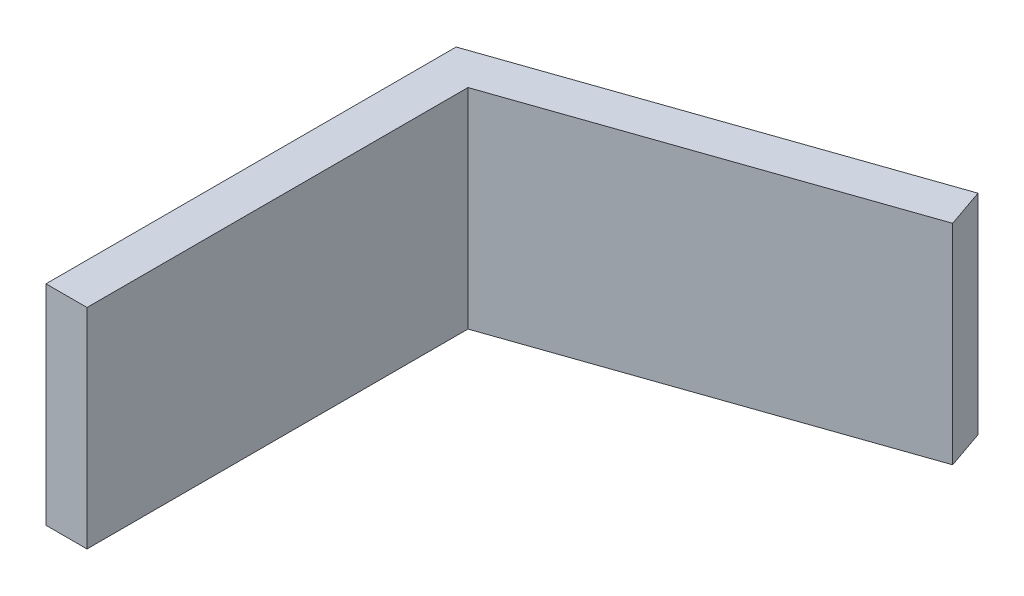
from build123d import *

# Parameters (mm, degrees)
SALIENTE_EXTRUIR1_DEPTH = 25.5


with BuildPart() as part:
    # Croquis1 → Saliente-Extruir1 (new, symmetric)
    with BuildSketch(Plane(origin=(0, 0, 0), x_dir=(1, 0, 0), z_dir=(0, 1, 0))):
        Polygon((-5, 91.117591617), (-5, -8.882408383), (5, -8.882408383), (5, 84.000413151), (92.759052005, 114.42355118), (89.48361985, 123.871913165), align=None)
    extrude(amount=SALIENTE_EXTRUIR1_DEPTH, both=True)


solid = part.part
